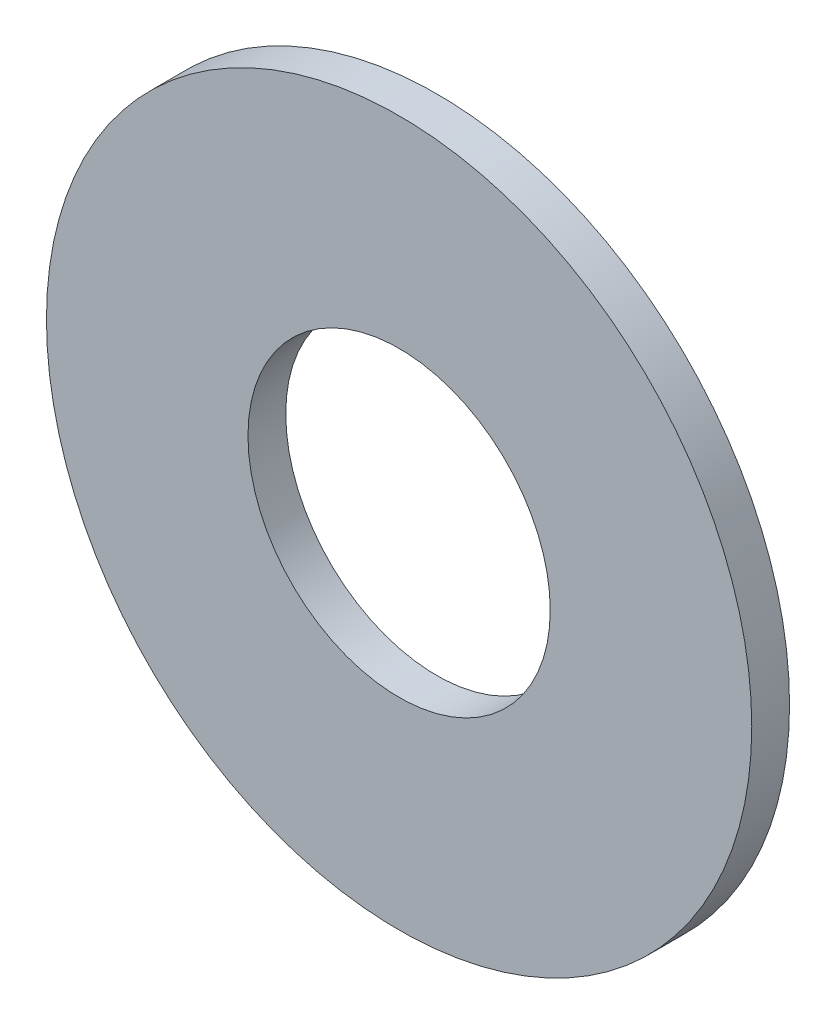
ISO-10303-21;
HEADER;
FILE_DESCRIPTION(('STEP AP214'),'2;1');
FILE_NAME('part.step','',(''),(''),'','','');
FILE_SCHEMA(('AUTOMOTIVE_DESIGN { 1 0 10303 214 1 1 1 1 }'));
ENDSEC;
DATA;
#1=APPLICATION_CONTEXT('core data for automotive mechanical design processes');
#2=APPLICATION_PROTOCOL_DEFINITION('international standard','automotive_design',2000,#1);
#3=PRODUCT_CONTEXT('',#1,'mechanical');
#4=PRODUCT('Part','Part','',(#3));
#5=PRODUCT_RELATED_PRODUCT_CATEGORY('part','',(#4));
#6=PRODUCT_DEFINITION_FORMATION('','',#4);
#7=PRODUCT_DEFINITION_CONTEXT('part definition',#1,'design');
#8=PRODUCT_DEFINITION('design','',#6,#7);
#9=PRODUCT_DEFINITION_SHAPE('','',#8);
#10=(LENGTH_UNIT() NAMED_UNIT(*) SI_UNIT(.MILLI.,.METRE.));
#11=(NAMED_UNIT(*) PLANE_ANGLE_UNIT() SI_UNIT($,.RADIAN.));
#12=(NAMED_UNIT(*) SI_UNIT($,.STERADIAN.) SOLID_ANGLE_UNIT());
#13=UNCERTAINTY_MEASURE_WITH_UNIT(LENGTH_MEASURE(1.E-05),#10,'distance_accuracy_value','');
#14=(GEOMETRIC_REPRESENTATION_CONTEXT(3) GLOBAL_UNCERTAINTY_ASSIGNED_CONTEXT((#13)) GLOBAL_UNIT_ASSIGNED_CONTEXT((#10,
#11,#12)) REPRESENTATION_CONTEXT('',''));
#15=CARTESIAN_POINT('',(0.,0.,0.));
#16=DIRECTION('',(0.,0.,1.));
#17=DIRECTION('',(1.,0.,0.));
#18=AXIS2_PLACEMENT_3D('',#15,#16,#17);
#19=CARTESIAN_POINT('',(0.,0.,3.));
#20=DIRECTION('',(0.,0.,1.));
#21=DIRECTION('',(1.,0.,0.));
#22=AXIS2_PLACEMENT_3D('',#19,#20,#21);
#23=PLANE('',#22);
#24=CARTESIAN_POINT('',(0.,0.,3.));
#25=DIRECTION('',(0.,0.,1.));
#26=DIRECTION('',(1.,0.,0.));
#27=AXIS2_PLACEMENT_3D('',#24,#25,#26);
#28=CIRCLE('',#27,28.);
#29=CARTESIAN_POINT('',(-28.,0.,3.));
#30=VERTEX_POINT('',#29);
#31=EDGE_CURVE('E10',#30,#30,#28,.T.);
#32=ORIENTED_EDGE('',*,*,#31,.T.);
#33=EDGE_LOOP('',(#32));
#34=FACE_BOUND('',#33,.T.);
#35=CARTESIAN_POINT('',(0.,0.,3.));
#36=DIRECTION('',(0.,0.,1.));
#37=DIRECTION('',(1.,0.,0.));
#38=AXIS2_PLACEMENT_3D('',#35,#36,#37);
#39=CIRCLE('',#38,12.);
#40=CARTESIAN_POINT('',(-12.,0.,3.));
#41=VERTEX_POINT('',#40);
#42=EDGE_CURVE('E41',#41,#41,#39,.T.);
#43=ORIENTED_EDGE('',*,*,#42,.F.);
#44=EDGE_LOOP('',(#43));
#45=FACE_BOUND('',#44,.T.);
#46=ADVANCED_FACE('F30',(#34,#45),#23,.T.);
#47=CARTESIAN_POINT('',(0.,0.,0.));
#48=DIRECTION('',(0.,0.,1.));
#49=DIRECTION('',(1.,0.,0.));
#50=AXIS2_PLACEMENT_3D('',#47,#48,#49);
#51=PLANE('',#50);
#52=CARTESIAN_POINT('',(0.,0.,0.));
#53=DIRECTION('',(0.,0.,1.));
#54=DIRECTION('',(1.,0.,0.));
#55=AXIS2_PLACEMENT_3D('',#52,#53,#54);
#56=CIRCLE('',#55,28.);
#57=CARTESIAN_POINT('',(-28.,0.,0.));
#58=VERTEX_POINT('',#57);
#59=EDGE_CURVE('E37',#58,#58,#56,.T.);
#60=ORIENTED_EDGE('',*,*,#59,.F.);
#61=EDGE_LOOP('',(#60));
#62=FACE_BOUND('',#61,.T.);
#63=CARTESIAN_POINT('',(0.,0.,0.));
#64=DIRECTION('',(0.,0.,1.));
#65=DIRECTION('',(1.,0.,0.));
#66=AXIS2_PLACEMENT_3D('',#63,#64,#65);
#67=CIRCLE('',#66,12.);
#68=CARTESIAN_POINT('',(-12.,0.,0.));
#69=VERTEX_POINT('',#68);
#70=EDGE_CURVE('E45',#69,#69,#67,.T.);
#71=ORIENTED_EDGE('',*,*,#70,.T.);
#72=EDGE_LOOP('',(#71));
#73=FACE_BOUND('',#72,.T.);
#74=ADVANCED_FACE('F51',(#62,#73),#51,.F.);
#75=CARTESIAN_POINT('',(0.,0.,3.));
#76=DIRECTION('',(0.,0.,-1.));
#77=DIRECTION('',(-1.,0.,0.));
#78=AXIS2_PLACEMENT_3D('',#75,#76,#77);
#79=CYLINDRICAL_SURFACE('',#78,28.);
#80=CARTESIAN_POINT('',(-28.,0.,3.));
#81=CARTESIAN_POINT('',(-28.,0.,2.96875));
#82=CARTESIAN_POINT('',(-28.,0.,2.9375));
#83=CARTESIAN_POINT('',(-28.,0.,2.875));
#84=CARTESIAN_POINT('',(-28.,0.,2.84375));
#85=CARTESIAN_POINT('',(-28.,0.,2.78125));
#86=CARTESIAN_POINT('',(-28.,0.,2.75));
#87=CARTESIAN_POINT('',(-28.,0.,2.6875));
#88=CARTESIAN_POINT('',(-28.,0.,2.65625));
#89=CARTESIAN_POINT('',(-28.,0.,2.59375));
#90=CARTESIAN_POINT('',(-28.,0.,2.5625));
#91=CARTESIAN_POINT('',(-28.,0.,2.5));
#92=CARTESIAN_POINT('',(-28.,0.,2.46875));
#93=CARTESIAN_POINT('',(-28.,0.,2.40625));
#94=CARTESIAN_POINT('',(-28.,0.,2.375));
#95=CARTESIAN_POINT('',(-28.,0.,2.3125));
#96=CARTESIAN_POINT('',(-28.,0.,2.28125));
#97=CARTESIAN_POINT('',(-28.,0.,2.21875));
#98=CARTESIAN_POINT('',(-28.,0.,2.1875));
#99=CARTESIAN_POINT('',(-28.,0.,2.125));
#100=CARTESIAN_POINT('',(-28.,0.,2.09375));
#101=CARTESIAN_POINT('',(-28.,0.,2.03125));
#102=CARTESIAN_POINT('',(-28.,0.,2.));
#103=CARTESIAN_POINT('',(-28.,0.,1.9375));
#104=CARTESIAN_POINT('',(-28.,0.,1.90625));
#105=CARTESIAN_POINT('',(-28.,0.,1.84375));
#106=CARTESIAN_POINT('',(-28.,0.,1.8125));
#107=CARTESIAN_POINT('',(-28.,0.,1.75));
#108=CARTESIAN_POINT('',(-28.,0.,1.71875));
#109=CARTESIAN_POINT('',(-28.,0.,1.65625));
#110=CARTESIAN_POINT('',(-28.,0.,1.625));
#111=CARTESIAN_POINT('',(-28.,0.,1.5625));
#112=CARTESIAN_POINT('',(-28.,0.,1.53125));
#113=CARTESIAN_POINT('',(-28.,0.,1.46875));
#114=CARTESIAN_POINT('',(-28.,0.,1.4375));
#115=CARTESIAN_POINT('',(-28.,0.,1.375));
#116=CARTESIAN_POINT('',(-28.,0.,1.34375));
#117=CARTESIAN_POINT('',(-28.,0.,1.28125));
#118=CARTESIAN_POINT('',(-28.,0.,1.25));
#119=CARTESIAN_POINT('',(-28.,0.,1.1875));
#120=CARTESIAN_POINT('',(-28.,0.,1.15625));
#121=CARTESIAN_POINT('',(-28.,0.,1.09375));
#122=CARTESIAN_POINT('',(-28.,0.,1.0625));
#123=CARTESIAN_POINT('',(-28.,0.,0.999999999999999));
#124=CARTESIAN_POINT('',(-28.,0.,0.968749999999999));
#125=CARTESIAN_POINT('',(-28.,0.,0.906249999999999));
#126=CARTESIAN_POINT('',(-28.,0.,0.874999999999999));
#127=CARTESIAN_POINT('',(-28.,0.,0.812499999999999));
#128=CARTESIAN_POINT('',(-28.,0.,0.781249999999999));
#129=CARTESIAN_POINT('',(-28.,0.,0.718749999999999));
#130=CARTESIAN_POINT('',(-28.,0.,0.687499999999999));
#131=CARTESIAN_POINT('',(-28.,0.,0.624999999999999));
#132=CARTESIAN_POINT('',(-28.,0.,0.593749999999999));
#133=CARTESIAN_POINT('',(-28.,0.,0.531249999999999));
#134=CARTESIAN_POINT('',(-28.,0.,0.499999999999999));
#135=CARTESIAN_POINT('',(-28.,0.,0.437499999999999));
#136=CARTESIAN_POINT('',(-28.,0.,0.406249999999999));
#137=CARTESIAN_POINT('',(-28.,0.,0.343749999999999));
#138=CARTESIAN_POINT('',(-28.,0.,0.312499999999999));
#139=CARTESIAN_POINT('',(-28.,0.,0.249999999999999));
#140=CARTESIAN_POINT('',(-28.,0.,0.218749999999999));
#141=CARTESIAN_POINT('',(-28.,0.,0.156249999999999));
#142=CARTESIAN_POINT('',(-28.,0.,0.125));
#143=CARTESIAN_POINT('',(-28.,0.,0.0624999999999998));
#144=CARTESIAN_POINT('',(-28.,0.,0.0312499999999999));
#145=CARTESIAN_POINT('',(-28.,0.,0.));
#146=B_SPLINE_CURVE_WITH_KNOTS('',3,(#80,#81,#82,#83,#84,#85,#86,#87,#88,#89,#90,#91,#92,#93,
#94,#95,#96,#97,#98,#99,#100,#101,#102,#103,#104,#105,#106,#107,#108,#109,#110,#111,#112,#113,
#114,#115,#116,#117,#118,#119,#120,#121,#122,#123,#124,#125,#126,#127,#128,#129,#130,#131,#132,
#133,#134,#135,#136,#137,#138,#139,#140,#141,#142,#143,#144,#145),.UNSPECIFIED.,.F.,.F.,(4,2,2,
2,2,2,2,2,2,2,2,2,2,2,2,2,2,2,2,2,2,2,2,2,2,2,2,2,2,2,2,2,4),(0.,0.0937500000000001,0.1875,
0.28125,0.374999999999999,0.46875,0.5625,0.656249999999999,0.749999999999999,0.843749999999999,
0.937499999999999,1.03125,1.125,1.21875,1.3125,1.40625,1.5,1.59375,1.6875,1.78125,1.875,1.96875,
2.0625,2.15625,2.25,2.34375,2.4375,2.53125,2.625,2.71875,2.8125,2.90625,3.),.UNSPECIFIED.);
#147=EDGE_CURVE('BSEAM32',#30,#58,#146,.T.);
#148=ORIENTED_EDGE('',*,*,#31,.F.);
#149=ORIENTED_EDGE('',*,*,#59,.T.);
#150=ORIENTED_EDGE('',*,*,#147,.T.);
#151=ORIENTED_EDGE('',*,*,#147,.F.);
#152=EDGE_LOOP('',(#148,#150,#149,#151));
#153=FACE_BOUND('',#152,.T.);
#154=ADVANCED_FACE('F32',(#153),#79,.T.);
#155=CARTESIAN_POINT('',(0.,0.,3.));
#156=DIRECTION('',(0.,0.,-1.));
#157=DIRECTION('',(-1.,0.,0.));
#158=AXIS2_PLACEMENT_3D('',#155,#156,#157);
#159=CYLINDRICAL_SURFACE('',#158,12.);
#160=CARTESIAN_POINT('',(-12.,0.,3.));
#161=CARTESIAN_POINT('',(-12.,0.,2.96875));
#162=CARTESIAN_POINT('',(-12.,0.,2.9375));
#163=CARTESIAN_POINT('',(-12.,0.,2.875));
#164=CARTESIAN_POINT('',(-12.,0.,2.84375));
#165=CARTESIAN_POINT('',(-12.,0.,2.78125));
#166=CARTESIAN_POINT('',(-12.,0.,2.75));
#167=CARTESIAN_POINT('',(-12.,0.,2.6875));
#168=CARTESIAN_POINT('',(-12.,0.,2.65625));
#169=CARTESIAN_POINT('',(-12.,0.,2.59375));
#170=CARTESIAN_POINT('',(-12.,0.,2.5625));
#171=CARTESIAN_POINT('',(-12.,0.,2.5));
#172=CARTESIAN_POINT('',(-12.,0.,2.46875));
#173=CARTESIAN_POINT('',(-12.,0.,2.40625));
#174=CARTESIAN_POINT('',(-12.,0.,2.375));
#175=CARTESIAN_POINT('',(-12.,0.,2.3125));
#176=CARTESIAN_POINT('',(-12.,0.,2.28125));
#177=CARTESIAN_POINT('',(-12.,0.,2.21875));
#178=CARTESIAN_POINT('',(-12.,0.,2.1875));
#179=CARTESIAN_POINT('',(-12.,0.,2.125));
#180=CARTESIAN_POINT('',(-12.,0.,2.09375));
#181=CARTESIAN_POINT('',(-12.,0.,2.03125));
#182=CARTESIAN_POINT('',(-12.,0.,2.));
#183=CARTESIAN_POINT('',(-12.,0.,1.9375));
#184=CARTESIAN_POINT('',(-12.,0.,1.90625));
#185=CARTESIAN_POINT('',(-12.,0.,1.84375));
#186=CARTESIAN_POINT('',(-12.,0.,1.8125));
#187=CARTESIAN_POINT('',(-12.,0.,1.75));
#188=CARTESIAN_POINT('',(-12.,0.,1.71875));
#189=CARTESIAN_POINT('',(-12.,0.,1.65625));
#190=CARTESIAN_POINT('',(-12.,0.,1.625));
#191=CARTESIAN_POINT('',(-12.,0.,1.5625));
#192=CARTESIAN_POINT('',(-12.,0.,1.53125));
#193=CARTESIAN_POINT('',(-12.,0.,1.46875));
#194=CARTESIAN_POINT('',(-12.,0.,1.4375));
#195=CARTESIAN_POINT('',(-12.,0.,1.375));
#196=CARTESIAN_POINT('',(-12.,0.,1.34375));
#197=CARTESIAN_POINT('',(-12.,0.,1.28125));
#198=CARTESIAN_POINT('',(-12.,0.,1.25));
#199=CARTESIAN_POINT('',(-12.,0.,1.1875));
#200=CARTESIAN_POINT('',(-12.,0.,1.15625));
#201=CARTESIAN_POINT('',(-12.,0.,1.09375));
#202=CARTESIAN_POINT('',(-12.,0.,1.0625));
#203=CARTESIAN_POINT('',(-12.,0.,0.999999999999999));
#204=CARTESIAN_POINT('',(-12.,0.,0.968749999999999));
#205=CARTESIAN_POINT('',(-12.,0.,0.906249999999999));
#206=CARTESIAN_POINT('',(-12.,0.,0.874999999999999));
#207=CARTESIAN_POINT('',(-12.,0.,0.812499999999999));
#208=CARTESIAN_POINT('',(-12.,0.,0.781249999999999));
#209=CARTESIAN_POINT('',(-12.,0.,0.718749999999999));
#210=CARTESIAN_POINT('',(-12.,0.,0.687499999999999));
#211=CARTESIAN_POINT('',(-12.,0.,0.624999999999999));
#212=CARTESIAN_POINT('',(-12.,0.,0.593749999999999));
#213=CARTESIAN_POINT('',(-12.,0.,0.531249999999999));
#214=CARTESIAN_POINT('',(-12.,0.,0.499999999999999));
#215=CARTESIAN_POINT('',(-12.,0.,0.437499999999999));
#216=CARTESIAN_POINT('',(-12.,0.,0.406249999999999));
#217=CARTESIAN_POINT('',(-12.,0.,0.343749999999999));
#218=CARTESIAN_POINT('',(-12.,0.,0.312499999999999));
#219=CARTESIAN_POINT('',(-12.,0.,0.249999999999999));
#220=CARTESIAN_POINT('',(-12.,0.,0.218749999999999));
#221=CARTESIAN_POINT('',(-12.,0.,0.156249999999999));
#222=CARTESIAN_POINT('',(-12.,0.,0.125));
#223=CARTESIAN_POINT('',(-12.,0.,0.0624999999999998));
#224=CARTESIAN_POINT('',(-12.,0.,0.0312499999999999));
#225=CARTESIAN_POINT('',(-12.,0.,0.));
#226=B_SPLINE_CURVE_WITH_KNOTS('',3,(#160,#161,#162,#163,#164,#165,#166,#167,#168,#169,#170,
#171,#172,#173,#174,#175,#176,#177,#178,#179,#180,#181,#182,#183,#184,#185,#186,#187,#188,#189,
#190,#191,#192,#193,#194,#195,#196,#197,#198,#199,#200,#201,#202,#203,#204,#205,#206,#207,#208,
#209,#210,#211,#212,#213,#214,#215,#216,#217,#218,#219,#220,#221,#222,#223,#224,#225),
.UNSPECIFIED.,.F.,.F.,(4,2,2,2,2,2,2,2,2,2,2,2,2,2,2,2,2,2,2,2,2,2,2,2,2,2,2,2,2,2,2,2,4),(0.,
0.0937500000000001,0.1875,0.28125,0.374999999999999,0.46875,0.5625,0.656249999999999,
0.749999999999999,0.843749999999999,0.937499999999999,1.03125,1.125,1.21875,1.3125,1.40625,1.5,
1.59375,1.6875,1.78125,1.875,1.96875,2.0625,2.15625,2.25,2.34375,2.4375,2.53125,2.625,2.71875,
2.8125,2.90625,3.),.UNSPECIFIED.);
#227=EDGE_CURVE('BSEAM53',#41,#69,#226,.T.);
#228=ORIENTED_EDGE('',*,*,#42,.T.);
#229=ORIENTED_EDGE('',*,*,#70,.F.);
#230=ORIENTED_EDGE('',*,*,#227,.T.);
#231=ORIENTED_EDGE('',*,*,#227,.F.);
#232=EDGE_LOOP('',(#228,#230,#229,#231));
#233=FACE_BOUND('',#232,.T.);
#234=ADVANCED_FACE('F53',(#233),#159,.F.);
#235=CLOSED_SHELL('',(#46,#74,#154,#234));
#236=MANIFOLD_SOLID_BREP('B2',#235);
#237=ADVANCED_BREP_SHAPE_REPRESENTATION('',(#18,#236),#14);
#238=SHAPE_DEFINITION_REPRESENTATION(#9,#237);
ENDSEC;
END-ISO-10303-21;
